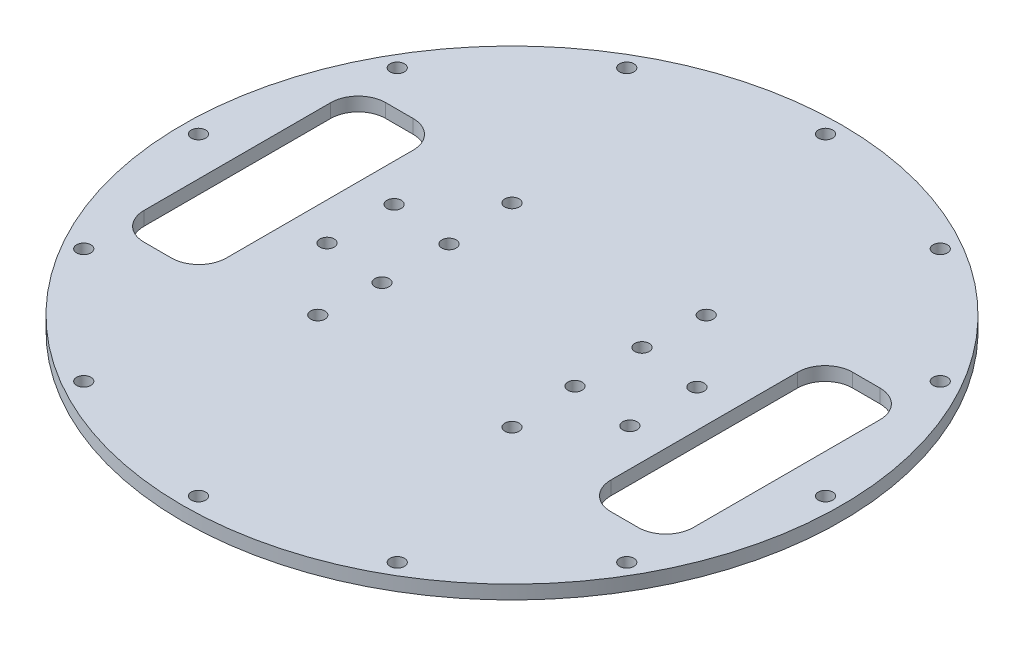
from build123d import *

# Parameters (mm, degrees)
SKETCH1_R      = 152.4
SKETCH1_R_2    = 3.302
EXTRUDE1_DEPTH = 6.35
SKETCH2_R      = 3.302
EXTRUDE3_DEPTH = 216.619670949
SKETCH2_6_R    = 3.302
EXTRUDE4_DEPTH = 216.619670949


with BuildPart() as part:
    # Sketch1 → Extrude1 (new body)
    with BuildSketch(Plane(origin=(0, 0, 0), x_dir=(1, 0, 0), z_dir=(0, 1, 0))):
        with Locations(Location((0, 0, 0), (0, 0, 270))):
            Circle(SKETCH1_R)
        with Locations(Location((-43.03131856, 13.91245376, 0), (0, 0, 270))):
            Circle(SKETCH1_R_2, mode=Mode.SUBTRACT)
        with Locations(Location((-43.03131856, -17.08745376, 0), (0, 0, 270))):
            Circle(SKETCH1_R_2, mode=Mode.SUBTRACT)
        with Locations(Location((-71.60631856, 17.08745376, 0), (0, 0, 270))):
            Circle(SKETCH1_R_2, mode=Mode.SUBTRACT)
        with Locations(Location((-71.60631856, -13.91245376, 0), (0, 0, 270))):
            Circle(SKETCH1_R_2, mode=Mode.SUBTRACT)
        with Locations(Location((43.03131856, -13.91245376, 0), (0, 0, 270))):
            Circle(SKETCH1_R_2, mode=Mode.SUBTRACT)
        with Locations(Location((43.03131856, 17.08745376, 0), (0, 0, 270))):
            Circle(SKETCH1_R_2, mode=Mode.SUBTRACT)
        with Locations(Location((71.60631856, -17.08745376, 0), (0, 0, 270))):
            Circle(SKETCH1_R_2, mode=Mode.SUBTRACT)
        with Locations(Location((71.60631856, 13.91245376, 0), (0, 0, 270))):
            Circle(SKETCH1_R_2, mode=Mode.SUBTRACT)
        with BuildLine():
            Line((-101.6, 55.88), (-114.3, 55.88))
            ThreePointArc((-114.3, 55.88), (-123.280256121, 52.160256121), (-127, 43.18))
            Line((-127, 43.18), (-127, -43.18))
            ThreePointArc((-127, -43.18), (-123.280256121, -52.160256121), (-114.3, -55.88))
            Line((-114.3, -55.88), (-101.6, -55.88))
            ThreePointArc((-101.6, -55.88), (-92.619743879, -52.160256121), (-88.9, -43.18))
            Line((-88.9, -43.18), (-88.9, 43.18))
            ThreePointArc((-88.9, 43.18), (-92.619743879, 52.160256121), (-101.6, 55.88))
        make_face(mode=Mode.SUBTRACT)
        with BuildLine():
            Line((88.9, -43.18), (88.9, 43.18))
            ThreePointArc((88.9, 43.18), (92.619743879, 52.160256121), (101.6, 55.88))
            Line((101.6, 55.88), (114.3, 55.88))
            ThreePointArc((114.3, 55.88), (123.280256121, 52.160256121), (127, 43.18))
            Line((127, 43.18), (127, -43.18))
            ThreePointArc((127, -43.18), (123.280256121, -52.160256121), (114.3, -55.88))
            Line((114.3, -55.88), (101.6, -55.88))
            ThreePointArc((101.6, -55.88), (92.619743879, -52.160256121), (88.9, -43.18))
        make_face(mode=Mode.SUBTRACT)
    extrude(amount=EXTRUDE1_DEPTH)

    # Sketch2 → Extrude3 (cut, through all)
    with BuildSketch(Plane(origin=(0, 6.35, 0), x_dir=(1, 0, 0), z_dir=(0, 1, 0))):
        with Locations((-44.901280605, 44.901280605)):
            Circle(SKETCH2_R)
        with Locations((44.901280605, 44.901280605)):
            Circle(SKETCH2_R)
        with Locations((44.901280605, -44.901280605)):
            Circle(SKETCH2_R)
        with Locations((-44.901280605, -44.901280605)):
            Circle(SKETCH2_R)
    extrude(amount=-EXTRUDE3_DEPTH, mode=Mode.SUBTRACT)

    # Sketch2_6 → Extrude4 (cut, through all)
    with BuildSketch(Plane(origin=(0, 6.35, 0), x_dir=(1, 0, 0), z_dir=(0, 1, 0))):
        with Locations((-144.980924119, 0)):
            Circle(SKETCH2_6_R)
        with Locations((-125.557163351, 72.490462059)):
            Circle(SKETCH2_6_R)
        with Locations((-72.490462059, 125.557163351)):
            Circle(SKETCH2_6_R)
        with Locations((0, 144.980924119)):
            Circle(SKETCH2_6_R)
        with Locations((72.490462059, 125.557163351)):
            Circle(SKETCH2_6_R)
        with Locations((125.557163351, 72.490462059)):
            Circle(SKETCH2_6_R)
        with Locations((144.980924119, 0)):
            Circle(SKETCH2_6_R)
        with Locations((125.557163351, -72.490462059)):
            Circle(SKETCH2_6_R)
        with Locations((72.490462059, -125.557163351)):
            Circle(SKETCH2_6_R)
        with Locations((0, -144.980924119)):
            Circle(SKETCH2_6_R)
        with Locations((-72.490462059, -125.557163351)):
            Circle(SKETCH2_6_R)
        with Locations((-125.557163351, -72.490462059)):
            Circle(SKETCH2_6_R)
    extrude(amount=-EXTRUDE4_DEPTH, mode=Mode.SUBTRACT)


solid = part.part
